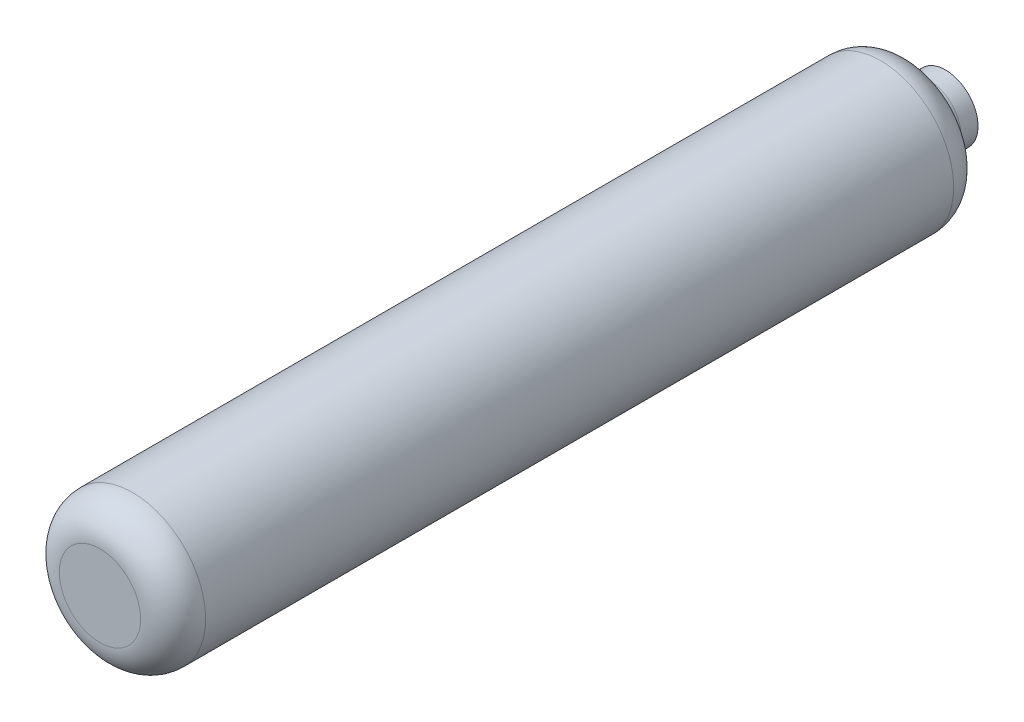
from build123d import *

# Parameters (mm, degrees)
SKETCH1_R           = 225
BOSS_EXTRUDE1_DEPTH = 2500
FILLET1_R           = 100
SKETCH2_R           = 100
BOSS_EXTRUDE2_DEPTH = 100
FILLET2_R           = 50
SCALE1_SCALE        = 0.105


with BuildPart() as part:
    # Sketch1 → Boss-Extrude1 (new body)
    with BuildSketch(Plane.XY):
        Circle(SKETCH1_R)
    extrude(amount=BOSS_EXTRUDE1_DEPTH)

    # Fillet1
    fillet1_edges = [part.edges().sort_by_distance(p)[0] for p in [
        (-225, 0, 0),
        (-225, 0, 2500),
    ]]
    fillet(fillet1_edges, radius=FILLET1_R)

    # Sketch2 → Boss-Extrude2 (add)
    with BuildSketch(Plane(origin=(0, 0, 0), x_dir=(-1, 0, 0), z_dir=(0, 0, -1))):
        with Locations(Location((0, 0, 0), (0, 0, 180))):
            Circle(SKETCH2_R)
    extrude(amount=BOSS_EXTRUDE2_DEPTH)

    # Fillet2
    fillet2_edges = [part.edges().sort_by_distance(p)[0] for p in [
        (-100, 0, 0),
    ]]
    fillet(fillet2_edges, radius=FILLET2_R)


with BuildPart() as part_1:
    # Scale1: scaled about (-3e-08, 0, 1238.677842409)
    add(part.part.scale(SCALE1_SCALE).moved(Location((-2.7e-08, 0, 1108.616668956))))


solid = part_1.part
